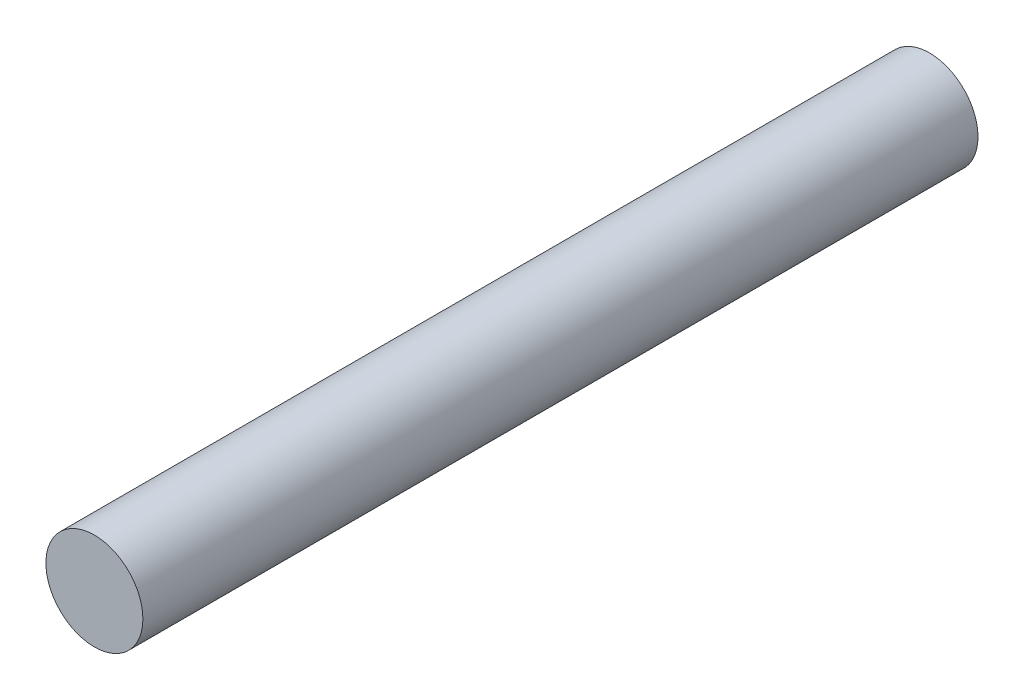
ISO-10303-21;
HEADER;
FILE_DESCRIPTION(('STEP AP214'),'2;1');
FILE_NAME('part.step','',(''),(''),'','','');
FILE_SCHEMA(('AUTOMOTIVE_DESIGN { 1 0 10303 214 1 1 1 1 }'));
ENDSEC;
DATA;
#1=APPLICATION_CONTEXT('core data for automotive mechanical design processes');
#2=APPLICATION_PROTOCOL_DEFINITION('international standard','automotive_design',2000,#1);
#3=PRODUCT_CONTEXT('',#1,'mechanical');
#4=PRODUCT('Part','Part','',(#3));
#5=PRODUCT_RELATED_PRODUCT_CATEGORY('part','',(#4));
#6=PRODUCT_DEFINITION_FORMATION('','',#4);
#7=PRODUCT_DEFINITION_CONTEXT('part definition',#1,'design');
#8=PRODUCT_DEFINITION('design','',#6,#7);
#9=PRODUCT_DEFINITION_SHAPE('','',#8);
#10=(LENGTH_UNIT() NAMED_UNIT(*) SI_UNIT(.MILLI.,.METRE.));
#11=(NAMED_UNIT(*) PLANE_ANGLE_UNIT() SI_UNIT($,.RADIAN.));
#12=(NAMED_UNIT(*) SI_UNIT($,.STERADIAN.) SOLID_ANGLE_UNIT());
#13=UNCERTAINTY_MEASURE_WITH_UNIT(LENGTH_MEASURE(1.E-05),#10,'distance_accuracy_value','');
#14=(GEOMETRIC_REPRESENTATION_CONTEXT(3) GLOBAL_UNCERTAINTY_ASSIGNED_CONTEXT((#13)) GLOBAL_UNIT_ASSIGNED_CONTEXT((#10,
#11,#12)) REPRESENTATION_CONTEXT('',''));
#15=CARTESIAN_POINT('',(0.,0.,0.));
#16=DIRECTION('',(0.,0.,1.));
#17=DIRECTION('',(1.,0.,0.));
#18=AXIS2_PLACEMENT_3D('',#15,#16,#17);
#19=CARTESIAN_POINT('',(0.,0.,155.));
#20=DIRECTION('',(0.,0.,-1.));
#21=DIRECTION('',(-1.,0.,0.));
#22=AXIS2_PLACEMENT_3D('',#19,#20,#21);
#23=CYLINDRICAL_SURFACE('',#22,9.);
#24=CARTESIAN_POINT('',(0.,0.,155.));
#25=DIRECTION('',(0.,0.,1.));
#26=DIRECTION('',(1.,0.,0.));
#27=AXIS2_PLACEMENT_3D('',#24,#25,#26);
#28=CIRCLE('',#27,9.);
#29=CARTESIAN_POINT('',(9.,0.,155.));
#30=VERTEX_POINT('',#29);
#31=EDGE_CURVE('E10',#30,#30,#28,.T.);
#32=ORIENTED_EDGE('',*,*,#31,.F.);
#33=EDGE_LOOP('',(#32));
#34=FACE_BOUND('',#33,.T.);
#35=CARTESIAN_POINT('',(0.,0.,0.));
#36=DIRECTION('',(0.,0.,1.));
#37=DIRECTION('',(1.,0.,0.));
#38=AXIS2_PLACEMENT_3D('',#35,#36,#37);
#39=CIRCLE('',#38,9.);
#40=CARTESIAN_POINT('',(9.,0.,0.));
#41=VERTEX_POINT('',#40);
#42=EDGE_CURVE('E40',#41,#41,#39,.T.);
#43=ORIENTED_EDGE('',*,*,#42,.T.);
#44=EDGE_LOOP('',(#43));
#45=FACE_BOUND('',#44,.T.);
#46=ADVANCED_FACE('F37',(#34,#45),#23,.T.);
#47=CARTESIAN_POINT('',(0.,0.,155.));
#48=DIRECTION('',(0.,0.,1.));
#49=DIRECTION('',(1.,0.,0.));
#50=AXIS2_PLACEMENT_3D('',#47,#48,#49);
#51=PLANE('',#50);
#52=ORIENTED_EDGE('',*,*,#31,.T.);
#53=EDGE_LOOP('',(#52));
#54=FACE_BOUND('',#53,.T.);
#55=ADVANCED_FACE('F54',(#54),#51,.T.);
#56=CARTESIAN_POINT('',(0.,0.,0.));
#57=DIRECTION('',(0.,0.,1.));
#58=DIRECTION('',(1.,0.,0.));
#59=AXIS2_PLACEMENT_3D('',#56,#57,#58);
#60=PLANE('',#59);
#61=ORIENTED_EDGE('',*,*,#42,.F.);
#62=EDGE_LOOP('',(#61));
#63=FACE_BOUND('',#62,.T.);
#64=ADVANCED_FACE('F52',(#63),#60,.F.);
#65=CLOSED_SHELL('',(#46,#55,#64));
#66=MANIFOLD_SOLID_BREP('B2',#65);
#67=ADVANCED_BREP_SHAPE_REPRESENTATION('',(#18,#66),#14);
#68=SHAPE_DEFINITION_REPRESENTATION(#9,#67);
ENDSEC;
END-ISO-10303-21;
